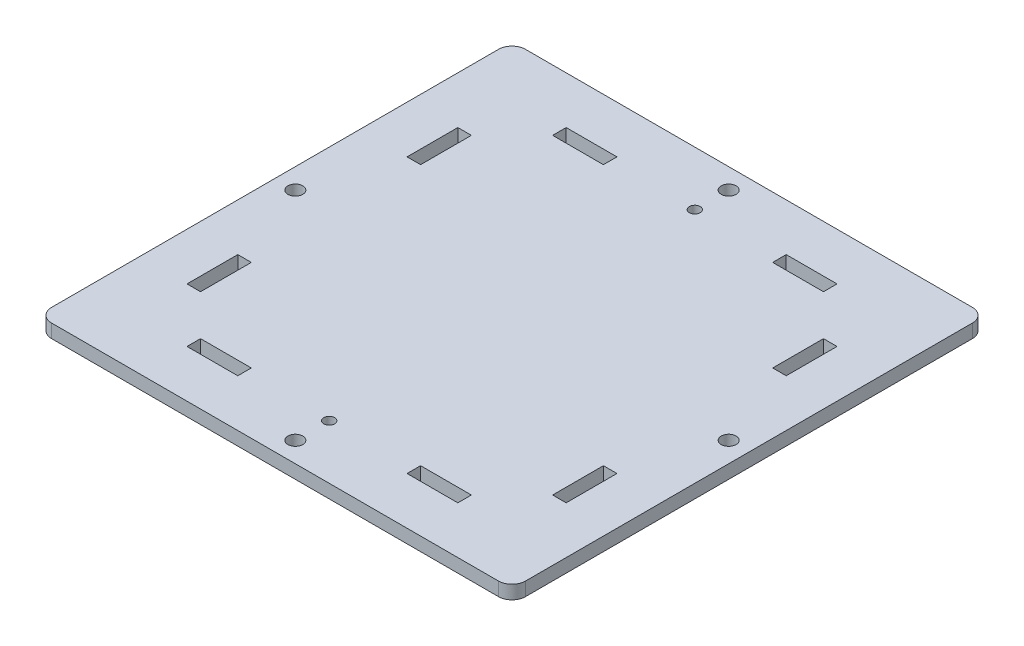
ISO-10303-21;
HEADER;
FILE_DESCRIPTION(('STEP AP214'),'2;1');
FILE_NAME('part.step','',(''),(''),'','','');
FILE_SCHEMA(('AUTOMOTIVE_DESIGN { 1 0 10303 214 1 1 1 1 }'));
ENDSEC;
DATA;
#1=APPLICATION_CONTEXT('core data for automotive mechanical design processes');
#2=APPLICATION_PROTOCOL_DEFINITION('international standard','automotive_design',2000,#1);
#3=PRODUCT_CONTEXT('',#1,'mechanical');
#4=PRODUCT('Part','Part','',(#3));
#5=PRODUCT_RELATED_PRODUCT_CATEGORY('part','',(#4));
#6=PRODUCT_DEFINITION_FORMATION('','',#4);
#7=PRODUCT_DEFINITION_CONTEXT('part definition',#1,'design');
#8=PRODUCT_DEFINITION('design','',#6,#7);
#9=PRODUCT_DEFINITION_SHAPE('','',#8);
#10=(LENGTH_UNIT() NAMED_UNIT(*) SI_UNIT(.MILLI.,.METRE.));
#11=(NAMED_UNIT(*) PLANE_ANGLE_UNIT() SI_UNIT($,.RADIAN.));
#12=(NAMED_UNIT(*) SI_UNIT($,.STERADIAN.) SOLID_ANGLE_UNIT());
#13=UNCERTAINTY_MEASURE_WITH_UNIT(LENGTH_MEASURE(1.E-05),#10,'distance_accuracy_value','');
#14=(GEOMETRIC_REPRESENTATION_CONTEXT(3) GLOBAL_UNCERTAINTY_ASSIGNED_CONTEXT((#13)) GLOBAL_UNIT_ASSIGNED_CONTEXT((#10,
#11,#12)) REPRESENTATION_CONTEXT('',''));
#15=CARTESIAN_POINT('',(0.,0.,0.));
#16=DIRECTION('',(0.,0.,1.));
#17=DIRECTION('',(1.,0.,0.));
#18=AXIS2_PLACEMENT_3D('',#15,#16,#17);
#19=CARTESIAN_POINT('',(-66.,-4.,-66.));
#20=DIRECTION('',(0.,-1.,0.));
#21=DIRECTION('',(0.,0.,-1.));
#22=AXIS2_PLACEMENT_3D('',#19,#20,#21);
#23=PLANE('',#22);
#24=CARTESIAN_POINT('',(0.,-4.,-64.));
#25=DIRECTION('',(0.,-1.,0.));
#26=DIRECTION('',(0.,0.,-1.));
#27=AXIS2_PLACEMENT_3D('',#24,#25,#26);
#28=CIRCLE('',#27,2.2);
#29=CARTESIAN_POINT('',(0.,-4.,-66.2));
#30=VERTEX_POINT('',#29);
#31=EDGE_CURVE('E844',#30,#30,#28,.T.);
#32=ORIENTED_EDGE('',*,*,#31,.F.);
#33=EDGE_LOOP('',(#32));
#34=FACE_BOUND('',#33,.T.);
#35=CARTESIAN_POINT('',(0.,-4.,64.));
#36=DIRECTION('',(0.,-1.,0.));
#37=DIRECTION('',(0.,0.,-1.));
#38=AXIS2_PLACEMENT_3D('',#35,#36,#37);
#39=CIRCLE('',#38,2.19999999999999);
#40=CARTESIAN_POINT('',(0.,-4.,61.8));
#41=VERTEX_POINT('',#40);
#42=EDGE_CURVE('E319',#41,#41,#39,.T.);
#43=ORIENTED_EDGE('',*,*,#42,.F.);
#44=EDGE_LOOP('',(#43));
#45=FACE_BOUND('',#44,.T.);
#46=DIRECTION('',(0.,0.,1.));
#47=VECTOR('',#46,1.);
#48=CARTESIAN_POINT('',(-52.,-4.,-40.));
#49=LINE('',#48,#47);
#50=CARTESIAN_POINT('',(-52.,-4.,-40.));
#51=VERTEX_POINT('',#50);
#52=CARTESIAN_POINT('',(-52.,-4.,-25.));
#53=VERTEX_POINT('',#52);
#54=EDGE_CURVE('E331',#51,#53,#49,.T.);
#55=ORIENTED_EDGE('',*,*,#54,.F.);
#56=DIRECTION('',(1.,0.,0.));
#57=VECTOR('',#56,1.);
#58=CARTESIAN_POINT('',(-56.,-4.,-40.));
#59=LINE('',#58,#57);
#60=CARTESIAN_POINT('',(-56.,-4.,-40.));
#61=VERTEX_POINT('',#60);
#62=EDGE_CURVE('E329',#61,#51,#59,.T.);
#63=ORIENTED_EDGE('',*,*,#62,.F.);
#64=DIRECTION('',(0.,0.,-1.));
#65=VECTOR('',#64,1.);
#66=CARTESIAN_POINT('',(-56.,-4.,-40.));
#67=LINE('',#66,#65);
#68=CARTESIAN_POINT('',(-56.,-4.,-25.));
#69=VERTEX_POINT('',#68);
#70=EDGE_CURVE('E337',#69,#61,#67,.T.);
#71=ORIENTED_EDGE('',*,*,#70,.F.);
#72=DIRECTION('',(-1.,0.,0.));
#73=VECTOR('',#72,1.);
#74=CARTESIAN_POINT('',(-56.,-4.,-25.));
#75=LINE('',#74,#73);
#76=EDGE_CURVE('E334',#53,#69,#75,.T.);
#77=ORIENTED_EDGE('',*,*,#76,.F.);
#78=EDGE_LOOP('',(#55,#63,#71,#77));
#79=FACE_BOUND('',#78,.T.);
#80=DIRECTION('',(-1.,0.,0.));
#81=VECTOR('',#80,1.);
#82=CARTESIAN_POINT('',(40.,-4.,-52.));
#83=LINE('',#82,#81);
#84=CARTESIAN_POINT('',(40.,-4.,-52.));
#85=VERTEX_POINT('',#84);
#86=CARTESIAN_POINT('',(25.,-4.,-52.));
#87=VERTEX_POINT('',#86);
#88=EDGE_CURVE('E393',#85,#87,#83,.T.);
#89=ORIENTED_EDGE('',*,*,#88,.F.);
#90=DIRECTION('',(0.,0.,1.));
#91=VECTOR('',#90,1.);
#92=CARTESIAN_POINT('',(40.,-4.,-56.));
#93=LINE('',#92,#91);
#94=CARTESIAN_POINT('',(40.,-4.,-56.));
#95=VERTEX_POINT('',#94);
#96=EDGE_CURVE('E391',#95,#85,#93,.T.);
#97=ORIENTED_EDGE('',*,*,#96,.F.);
#98=DIRECTION('',(1.,0.,0.));
#99=VECTOR('',#98,1.);
#100=CARTESIAN_POINT('',(40.,-4.,-56.));
#101=LINE('',#100,#99);
#102=CARTESIAN_POINT('',(25.,-4.,-56.));
#103=VERTEX_POINT('',#102);
#104=EDGE_CURVE('E399',#103,#95,#101,.T.);
#105=ORIENTED_EDGE('',*,*,#104,.F.);
#106=DIRECTION('',(0.,0.,-1.));
#107=VECTOR('',#106,1.);
#108=CARTESIAN_POINT('',(25.,-4.,-56.));
#109=LINE('',#108,#107);
#110=EDGE_CURVE('E396',#87,#103,#109,.T.);
#111=ORIENTED_EDGE('',*,*,#110,.F.);
#112=EDGE_LOOP('',(#89,#97,#105,#111));
#113=FACE_BOUND('',#112,.T.);
#114=DIRECTION('',(0.,0.,-1.));
#115=VECTOR('',#114,1.);
#116=CARTESIAN_POINT('',(52.,-4.,40.));
#117=LINE('',#116,#115);
#118=CARTESIAN_POINT('',(52.,-4.,40.));
#119=VERTEX_POINT('',#118);
#120=CARTESIAN_POINT('',(52.,-4.,25.));
#121=VERTEX_POINT('',#120);
#122=EDGE_CURVE('E455',#119,#121,#117,.T.);
#123=ORIENTED_EDGE('',*,*,#122,.F.);
#124=DIRECTION('',(-1.,0.,0.));
#125=VECTOR('',#124,1.);
#126=CARTESIAN_POINT('',(56.,-4.,40.));
#127=LINE('',#126,#125);
#128=CARTESIAN_POINT('',(56.,-4.,40.));
#129=VERTEX_POINT('',#128);
#130=EDGE_CURVE('E453',#129,#119,#127,.T.);
#131=ORIENTED_EDGE('',*,*,#130,.F.);
#132=DIRECTION('',(0.,0.,1.));
#133=VECTOR('',#132,1.);
#134=CARTESIAN_POINT('',(56.,-4.,40.));
#135=LINE('',#134,#133);
#136=CARTESIAN_POINT('',(56.,-4.,25.));
#137=VERTEX_POINT('',#136);
#138=EDGE_CURVE('E461',#137,#129,#135,.T.);
#139=ORIENTED_EDGE('',*,*,#138,.F.);
#140=DIRECTION('',(1.,0.,0.));
#141=VECTOR('',#140,1.);
#142=CARTESIAN_POINT('',(56.,-4.,25.));
#143=LINE('',#142,#141);
#144=EDGE_CURVE('E458',#121,#137,#143,.T.);
#145=ORIENTED_EDGE('',*,*,#144,.F.);
#146=EDGE_LOOP('',(#123,#131,#139,#145));
#147=FACE_BOUND('',#146,.T.);
#148=DIRECTION('',(1.,0.,0.));
#149=VECTOR('',#148,1.);
#150=CARTESIAN_POINT('',(-40.,-4.,52.));
#151=LINE('',#150,#149);
#152=CARTESIAN_POINT('',(-40.,-4.,52.));
#153=VERTEX_POINT('',#152);
#154=CARTESIAN_POINT('',(-25.,-4.,52.));
#155=VERTEX_POINT('',#154);
#156=EDGE_CURVE('E517',#153,#155,#151,.T.);
#157=ORIENTED_EDGE('',*,*,#156,.F.);
#158=DIRECTION('',(0.,0.,-1.));
#159=VECTOR('',#158,1.);
#160=CARTESIAN_POINT('',(-40.,-4.,56.));
#161=LINE('',#160,#159);
#162=CARTESIAN_POINT('',(-40.,-4.,56.));
#163=VERTEX_POINT('',#162);
#164=EDGE_CURVE('E515',#163,#153,#161,.T.);
#165=ORIENTED_EDGE('',*,*,#164,.F.);
#166=DIRECTION('',(-1.,0.,0.));
#167=VECTOR('',#166,1.);
#168=CARTESIAN_POINT('',(-40.,-4.,56.));
#169=LINE('',#168,#167);
#170=CARTESIAN_POINT('',(-25.,-4.,56.));
#171=VERTEX_POINT('',#170);
#172=EDGE_CURVE('E523',#171,#163,#169,.T.);
#173=ORIENTED_EDGE('',*,*,#172,.F.);
#174=DIRECTION('',(0.,0.,1.));
#175=VECTOR('',#174,1.);
#176=CARTESIAN_POINT('',(-25.,-4.,56.));
#177=LINE('',#176,#175);
#178=EDGE_CURVE('E520',#155,#171,#177,.T.);
#179=ORIENTED_EDGE('',*,*,#178,.F.);
#180=EDGE_LOOP('',(#157,#165,#173,#179));
#181=FACE_BOUND('',#180,.T.);
#182=CARTESIAN_POINT('',(0.,-4.,54.));
#183=DIRECTION('',(0.,-1.,0.));
#184=DIRECTION('',(0.,0.,-1.));
#185=AXIS2_PLACEMENT_3D('',#182,#183,#184);
#186=CIRCLE('',#185,1.6);
#187=CARTESIAN_POINT('',(0.,-4.,52.4));
#188=VERTEX_POINT('',#187);
#189=EDGE_CURVE('E552',#188,#188,#186,.T.);
#190=ORIENTED_EDGE('',*,*,#189,.F.);
#191=EDGE_LOOP('',(#190));
#192=FACE_BOUND('',#191,.T.);
#193=CARTESIAN_POINT('',(-66.,-4.,-66.));
#194=DIRECTION('',(0.,-1.,0.));
#195=DIRECTION('',(0.,0.,-1.));
#196=AXIS2_PLACEMENT_3D('',#193,#194,#195);
#197=CIRCLE('',#196,4.00000000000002);
#198=CARTESIAN_POINT('',(-70.,-4.,-66.));
#199=VERTEX_POINT('',#198);
#200=CARTESIAN_POINT('',(-66.,-4.,-70.));
#201=VERTEX_POINT('',#200);
#202=EDGE_CURVE('E558',#199,#201,#197,.T.);
#203=ORIENTED_EDGE('',*,*,#202,.T.);
#204=DIRECTION('',(1.,0.,0.));
#205=VECTOR('',#204,1.);
#206=CARTESIAN_POINT('',(-66.,-4.,-70.));
#207=LINE('',#206,#205);
#208=CARTESIAN_POINT('',(66.,-4.,-70.));
#209=VERTEX_POINT('',#208);
#210=EDGE_CURVE('E561',#201,#209,#207,.T.);
#211=ORIENTED_EDGE('',*,*,#210,.T.);
#212=CARTESIAN_POINT('',(66.,-4.,-66.));
#213=DIRECTION('',(0.,-1.,0.));
#214=DIRECTION('',(0.,0.,1.));
#215=AXIS2_PLACEMENT_3D('',#212,#213,#214);
#216=CIRCLE('',#215,4.00000000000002);
#217=CARTESIAN_POINT('',(70.,-4.,-66.));
#218=VERTEX_POINT('',#217);
#219=EDGE_CURVE('E564',#209,#218,#216,.T.);
#220=ORIENTED_EDGE('',*,*,#219,.T.);
#221=DIRECTION('',(0.,0.,1.));
#222=VECTOR('',#221,1.);
#223=CARTESIAN_POINT('',(70.,-4.,66.));
#224=LINE('',#223,#222);
#225=CARTESIAN_POINT('',(70.,-4.,66.));
#226=VERTEX_POINT('',#225);
#227=EDGE_CURVE('E566',#218,#226,#224,.T.);
#228=ORIENTED_EDGE('',*,*,#227,.T.);
#229=CARTESIAN_POINT('',(66.,-4.,66.));
#230=DIRECTION('',(0.,-1.,0.));
#231=DIRECTION('',(0.,0.,1.));
#232=AXIS2_PLACEMENT_3D('',#229,#230,#231);
#233=CIRCLE('',#232,4.00000000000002);
#234=CARTESIAN_POINT('',(66.,-4.,70.));
#235=VERTEX_POINT('',#234);
#236=EDGE_CURVE('E568',#226,#235,#233,.T.);
#237=ORIENTED_EDGE('',*,*,#236,.T.);
#238=DIRECTION('',(-1.,0.,0.));
#239=VECTOR('',#238,1.);
#240=CARTESIAN_POINT('',(-66.,-4.,70.));
#241=LINE('',#240,#239);
#242=CARTESIAN_POINT('',(-66.,-4.,70.));
#243=VERTEX_POINT('',#242);
#244=EDGE_CURVE('E570',#235,#243,#241,.T.);
#245=ORIENTED_EDGE('',*,*,#244,.T.);
#246=CARTESIAN_POINT('',(-66.,-4.,65.9999999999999));
#247=DIRECTION('',(0.,-1.,0.));
#248=DIRECTION('',(0.,0.,-1.));
#249=AXIS2_PLACEMENT_3D('',#246,#247,#248);
#250=CIRCLE('',#249,4.00000000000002);
#251=CARTESIAN_POINT('',(-70.,-4.,66.));
#252=VERTEX_POINT('',#251);
#253=EDGE_CURVE('E572',#243,#252,#250,.T.);
#254=ORIENTED_EDGE('',*,*,#253,.T.);
#255=DIRECTION('',(0.,0.,-1.));
#256=VECTOR('',#255,1.);
#257=CARTESIAN_POINT('',(-70.,-4.,66.));
#258=LINE('',#257,#256);
#259=EDGE_CURVE('E574',#252,#199,#258,.T.);
#260=ORIENTED_EDGE('',*,*,#259,.T.);
#261=EDGE_LOOP('',(#203,#211,#220,#228,#237,#245,#254,#260));
#262=FACE_BOUND('',#261,.T.);
#263=CARTESIAN_POINT('',(0.,-4.,-54.));
#264=DIRECTION('',(0.,-1.,0.));
#265=DIRECTION('',(0.,0.,1.));
#266=AXIS2_PLACEMENT_3D('',#263,#264,#265);
#267=CIRCLE('',#266,1.6);
#268=CARTESIAN_POINT('',(0.,-4.,-52.4));
#269=VERTEX_POINT('',#268);
#270=EDGE_CURVE('E546',#269,#269,#267,.T.);
#271=ORIENTED_EDGE('',*,*,#270,.F.);
#272=EDGE_LOOP('',(#271));
#273=FACE_BOUND('',#272,.T.);
#274=DIRECTION('',(0.,0.,-1.));
#275=VECTOR('',#274,1.);
#276=CARTESIAN_POINT('',(25.,-4.,56.));
#277=LINE('',#276,#275);
#278=CARTESIAN_POINT('',(25.,-4.,56.));
#279=VERTEX_POINT('',#278);
#280=CARTESIAN_POINT('',(25.,-4.,52.));
#281=VERTEX_POINT('',#280);
#282=EDGE_CURVE('E486',#279,#281,#277,.T.);
#283=ORIENTED_EDGE('',*,*,#282,.F.);
#284=DIRECTION('',(-1.,0.,0.));
#285=VECTOR('',#284,1.);
#286=CARTESIAN_POINT('',(40.,-4.,56.));
#287=LINE('',#286,#285);
#288=CARTESIAN_POINT('',(40.,-4.,56.));
#289=VERTEX_POINT('',#288);
#290=EDGE_CURVE('E484',#289,#279,#287,.T.);
#291=ORIENTED_EDGE('',*,*,#290,.F.);
#292=DIRECTION('',(0.,0.,1.));
#293=VECTOR('',#292,1.);
#294=CARTESIAN_POINT('',(40.,-4.,56.));
#295=LINE('',#294,#293);
#296=CARTESIAN_POINT('',(40.,-4.,52.));
#297=VERTEX_POINT('',#296);
#298=EDGE_CURVE('E492',#297,#289,#295,.T.);
#299=ORIENTED_EDGE('',*,*,#298,.F.);
#300=DIRECTION('',(1.,0.,0.));
#301=VECTOR('',#300,1.);
#302=CARTESIAN_POINT('',(40.,-4.,52.));
#303=LINE('',#302,#301);
#304=EDGE_CURVE('E489',#281,#297,#303,.T.);
#305=ORIENTED_EDGE('',*,*,#304,.F.);
#306=EDGE_LOOP('',(#283,#291,#299,#305));
#307=FACE_BOUND('',#306,.T.);
#308=DIRECTION('',(-1.,0.,0.));
#309=VECTOR('',#308,1.);
#310=CARTESIAN_POINT('',(56.,-4.,-25.));
#311=LINE('',#310,#309);
#312=CARTESIAN_POINT('',(56.,-4.,-25.));
#313=VERTEX_POINT('',#312);
#314=CARTESIAN_POINT('',(52.,-4.,-25.));
#315=VERTEX_POINT('',#314);
#316=EDGE_CURVE('E424',#313,#315,#311,.T.);
#317=ORIENTED_EDGE('',*,*,#316,.F.);
#318=DIRECTION('',(0.,0.,1.));
#319=VECTOR('',#318,1.);
#320=CARTESIAN_POINT('',(56.,-4.,-40.));
#321=LINE('',#320,#319);
#322=CARTESIAN_POINT('',(56.,-4.,-40.));
#323=VERTEX_POINT('',#322);
#324=EDGE_CURVE('E422',#323,#313,#321,.T.);
#325=ORIENTED_EDGE('',*,*,#324,.F.);
#326=DIRECTION('',(1.,0.,0.));
#327=VECTOR('',#326,1.);
#328=CARTESIAN_POINT('',(56.,-4.,-40.));
#329=LINE('',#328,#327);
#330=CARTESIAN_POINT('',(52.,-4.,-40.));
#331=VERTEX_POINT('',#330);
#332=EDGE_CURVE('E430',#331,#323,#329,.T.);
#333=ORIENTED_EDGE('',*,*,#332,.F.);
#334=DIRECTION('',(0.,0.,-1.));
#335=VECTOR('',#334,1.);
#336=CARTESIAN_POINT('',(52.,-4.,-40.));
#337=LINE('',#336,#335);
#338=EDGE_CURVE('E427',#315,#331,#337,.T.);
#339=ORIENTED_EDGE('',*,*,#338,.F.);
#340=EDGE_LOOP('',(#317,#325,#333,#339));
#341=FACE_BOUND('',#340,.T.);
#342=DIRECTION('',(0.,0.,1.));
#343=VECTOR('',#342,1.);
#344=CARTESIAN_POINT('',(-25.,-4.,-56.));
#345=LINE('',#344,#343);
#346=CARTESIAN_POINT('',(-25.,-4.,-56.));
#347=VERTEX_POINT('',#346);
#348=CARTESIAN_POINT('',(-25.,-4.,-52.));
#349=VERTEX_POINT('',#348);
#350=EDGE_CURVE('E362',#347,#349,#345,.T.);
#351=ORIENTED_EDGE('',*,*,#350,.F.);
#352=DIRECTION('',(1.,0.,0.));
#353=VECTOR('',#352,1.);
#354=CARTESIAN_POINT('',(-40.,-4.,-56.));
#355=LINE('',#354,#353);
#356=CARTESIAN_POINT('',(-40.,-4.,-56.));
#357=VERTEX_POINT('',#356);
#358=EDGE_CURVE('E360',#357,#347,#355,.T.);
#359=ORIENTED_EDGE('',*,*,#358,.F.);
#360=DIRECTION('',(0.,0.,-1.));
#361=VECTOR('',#360,1.);
#362=CARTESIAN_POINT('',(-40.,-4.,-56.));
#363=LINE('',#362,#361);
#364=CARTESIAN_POINT('',(-40.,-4.,-52.));
#365=VERTEX_POINT('',#364);
#366=EDGE_CURVE('E368',#365,#357,#363,.T.);
#367=ORIENTED_EDGE('',*,*,#366,.F.);
#368=DIRECTION('',(-1.,0.,0.));
#369=VECTOR('',#368,1.);
#370=CARTESIAN_POINT('',(-40.,-4.,-52.));
#371=LINE('',#370,#369);
#372=EDGE_CURVE('E365',#349,#365,#371,.T.);
#373=ORIENTED_EDGE('',*,*,#372,.F.);
#374=EDGE_LOOP('',(#351,#359,#367,#373));
#375=FACE_BOUND('',#374,.T.);
#376=DIRECTION('',(1.,0.,0.));
#377=VECTOR('',#376,1.);
#378=CARTESIAN_POINT('',(-56.,-4.,25.));
#379=LINE('',#378,#377);
#380=CARTESIAN_POINT('',(-56.,-4.,25.));
#381=VERTEX_POINT('',#380);
#382=CARTESIAN_POINT('',(-52.,-4.,25.));
#383=VERTEX_POINT('',#382);
#384=EDGE_CURVE('E298',#381,#383,#379,.T.);
#385=ORIENTED_EDGE('',*,*,#384,.F.);
#386=DIRECTION('',(0.,0.,-1.));
#387=VECTOR('',#386,1.);
#388=CARTESIAN_POINT('',(-56.,-4.,40.));
#389=LINE('',#388,#387);
#390=CARTESIAN_POINT('',(-56.,-4.,40.));
#391=VERTEX_POINT('',#390);
#392=EDGE_CURVE('E290',#391,#381,#389,.T.);
#393=ORIENTED_EDGE('',*,*,#392,.F.);
#394=DIRECTION('',(-1.,0.,0.));
#395=VECTOR('',#394,1.);
#396=CARTESIAN_POINT('',(-56.,-4.,40.));
#397=LINE('',#396,#395);
#398=CARTESIAN_POINT('',(-52.,-4.,40.));
#399=VERTEX_POINT('',#398);
#400=EDGE_CURVE('E313',#399,#391,#397,.T.);
#401=ORIENTED_EDGE('',*,*,#400,.F.);
#402=DIRECTION('',(0.,0.,1.));
#403=VECTOR('',#402,1.);
#404=CARTESIAN_POINT('',(-52.,-4.,40.));
#405=LINE('',#404,#403);
#406=EDGE_CURVE('E311',#383,#399,#405,.T.);
#407=ORIENTED_EDGE('',*,*,#406,.F.);
#408=EDGE_LOOP('',(#385,#393,#401,#407));
#409=FACE_BOUND('',#408,.T.);
#410=CARTESIAN_POINT('',(64.,-4.,0.));
#411=DIRECTION('',(0.,-1.,0.));
#412=DIRECTION('',(0.,0.,-1.));
#413=AXIS2_PLACEMENT_3D('',#410,#411,#412);
#414=CIRCLE('',#413,2.2);
#415=CARTESIAN_POINT('',(64.,-4.,-2.2));
#416=VERTEX_POINT('',#415);
#417=EDGE_CURVE('E850',#416,#416,#414,.T.);
#418=ORIENTED_EDGE('',*,*,#417,.F.);
#419=EDGE_LOOP('',(#418));
#420=FACE_BOUND('',#419,.T.);
#421=CARTESIAN_POINT('',(-64.,-4.,0.));
#422=DIRECTION('',(0.,-1.,0.));
#423=DIRECTION('',(0.,0.,-1.));
#424=AXIS2_PLACEMENT_3D('',#421,#422,#423);
#425=CIRCLE('',#424,2.2);
#426=CARTESIAN_POINT('',(-64.,-4.,-2.20000000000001));
#427=VERTEX_POINT('',#426);
#428=EDGE_CURVE('E835',#427,#427,#425,.T.);
#429=ORIENTED_EDGE('',*,*,#428,.F.);
#430=EDGE_LOOP('',(#429));
#431=FACE_BOUND('',#430,.T.);
#432=ADVANCED_FACE('F33',(#34,#45,#79,#113,#147,#181,#192,#262,#273,#307,#341,#375,#409,#420,
#431),#23,.T.);
#433=CARTESIAN_POINT('',(-66.,0.,-66.));
#434=DIRECTION('',(0.,-1.,0.));
#435=DIRECTION('',(0.,0.,-1.));
#436=AXIS2_PLACEMENT_3D('',#433,#434,#435);
#437=PLANE('',#436);
#438=CARTESIAN_POINT('',(0.,0.,-64.));
#439=DIRECTION('',(0.,-1.,0.));
#440=DIRECTION('',(0.,0.,-1.));
#441=AXIS2_PLACEMENT_3D('',#438,#439,#440);
#442=CIRCLE('',#441,2.2);
#443=CARTESIAN_POINT('',(0.,0.,-66.2));
#444=VERTEX_POINT('',#443);
#445=EDGE_CURVE('E841',#444,#444,#442,.T.);
#446=ORIENTED_EDGE('',*,*,#445,.T.);
#447=EDGE_LOOP('',(#446));
#448=FACE_BOUND('',#447,.T.);
#449=CARTESIAN_POINT('',(0.,0.,64.));
#450=DIRECTION('',(0.,-1.,0.));
#451=DIRECTION('',(0.,0.,-1.));
#452=AXIS2_PLACEMENT_3D('',#449,#450,#451);
#453=CIRCLE('',#452,2.19999999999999);
#454=CARTESIAN_POINT('',(0.,0.,61.8));
#455=VERTEX_POINT('',#454);
#456=EDGE_CURVE('E853',#455,#455,#453,.T.);
#457=ORIENTED_EDGE('',*,*,#456,.T.);
#458=EDGE_LOOP('',(#457));
#459=FACE_BOUND('',#458,.T.);
#460=DIRECTION('',(1.,0.,0.));
#461=VECTOR('',#460,1.);
#462=CARTESIAN_POINT('',(-56.,0.,-40.));
#463=LINE('',#462,#461);
#464=CARTESIAN_POINT('',(-56.,0.,-40.));
#465=VERTEX_POINT('',#464);
#466=CARTESIAN_POINT('',(-52.,0.,-40.));
#467=VERTEX_POINT('',#466);
#468=EDGE_CURVE('E306',#465,#467,#463,.T.);
#469=ORIENTED_EDGE('',*,*,#468,.T.);
#470=DIRECTION('',(0.,0.,1.));
#471=VECTOR('',#470,1.);
#472=CARTESIAN_POINT('',(-52.,0.,-40.));
#473=LINE('',#472,#471);
#474=CARTESIAN_POINT('',(-52.,0.,-25.));
#475=VERTEX_POINT('',#474);
#476=EDGE_CURVE('E342',#467,#475,#473,.T.);
#477=ORIENTED_EDGE('',*,*,#476,.T.);
#478=DIRECTION('',(-1.,0.,0.));
#479=VECTOR('',#478,1.);
#480=CARTESIAN_POINT('',(-56.,0.,-25.));
#481=LINE('',#480,#479);
#482=CARTESIAN_POINT('',(-56.,0.,-25.));
#483=VERTEX_POINT('',#482);
#484=EDGE_CURVE('E345',#475,#483,#481,.T.);
#485=ORIENTED_EDGE('',*,*,#484,.T.);
#486=DIRECTION('',(0.,0.,-1.));
#487=VECTOR('',#486,1.);
#488=CARTESIAN_POINT('',(-56.,0.,-40.));
#489=LINE('',#488,#487);
#490=EDGE_CURVE('E332',#483,#465,#489,.T.);
#491=ORIENTED_EDGE('',*,*,#490,.T.);
#492=EDGE_LOOP('',(#469,#477,#485,#491));
#493=FACE_BOUND('',#492,.T.);
#494=DIRECTION('',(0.,0.,1.));
#495=VECTOR('',#494,1.);
#496=CARTESIAN_POINT('',(40.,0.,-56.));
#497=LINE('',#496,#495);
#498=CARTESIAN_POINT('',(40.,0.,-56.));
#499=VERTEX_POINT('',#498);
#500=CARTESIAN_POINT('',(40.,0.,-52.));
#501=VERTEX_POINT('',#500);
#502=EDGE_CURVE('E390',#499,#501,#497,.T.);
#503=ORIENTED_EDGE('',*,*,#502,.T.);
#504=DIRECTION('',(-1.,0.,0.));
#505=VECTOR('',#504,1.);
#506=CARTESIAN_POINT('',(40.,0.,-52.));
#507=LINE('',#506,#505);
#508=CARTESIAN_POINT('',(25.,0.,-52.));
#509=VERTEX_POINT('',#508);
#510=EDGE_CURVE('E404',#501,#509,#507,.T.);
#511=ORIENTED_EDGE('',*,*,#510,.T.);
#512=DIRECTION('',(0.,0.,-1.));
#513=VECTOR('',#512,1.);
#514=CARTESIAN_POINT('',(25.,0.,-56.));
#515=LINE('',#514,#513);
#516=CARTESIAN_POINT('',(25.,0.,-56.));
#517=VERTEX_POINT('',#516);
#518=EDGE_CURVE('E407',#509,#517,#515,.T.);
#519=ORIENTED_EDGE('',*,*,#518,.T.);
#520=DIRECTION('',(1.,0.,0.));
#521=VECTOR('',#520,1.);
#522=CARTESIAN_POINT('',(40.,0.,-56.));
#523=LINE('',#522,#521);
#524=EDGE_CURVE('E394',#517,#499,#523,.T.);
#525=ORIENTED_EDGE('',*,*,#524,.T.);
#526=EDGE_LOOP('',(#503,#511,#519,#525));
#527=FACE_BOUND('',#526,.T.);
#528=DIRECTION('',(-1.,0.,0.));
#529=VECTOR('',#528,1.);
#530=CARTESIAN_POINT('',(56.,0.,40.));
#531=LINE('',#530,#529);
#532=CARTESIAN_POINT('',(56.,0.,40.));
#533=VERTEX_POINT('',#532);
#534=CARTESIAN_POINT('',(52.,0.,40.));
#535=VERTEX_POINT('',#534);
#536=EDGE_CURVE('E452',#533,#535,#531,.T.);
#537=ORIENTED_EDGE('',*,*,#536,.T.);
#538=DIRECTION('',(0.,0.,-1.));
#539=VECTOR('',#538,1.);
#540=CARTESIAN_POINT('',(52.,0.,40.));
#541=LINE('',#540,#539);
#542=CARTESIAN_POINT('',(52.,0.,25.));
#543=VERTEX_POINT('',#542);
#544=EDGE_CURVE('E466',#535,#543,#541,.T.);
#545=ORIENTED_EDGE('',*,*,#544,.T.);
#546=DIRECTION('',(1.,0.,0.));
#547=VECTOR('',#546,1.);
#548=CARTESIAN_POINT('',(56.,0.,25.));
#549=LINE('',#548,#547);
#550=CARTESIAN_POINT('',(56.,0.,25.));
#551=VERTEX_POINT('',#550);
#552=EDGE_CURVE('E469',#543,#551,#549,.T.);
#553=ORIENTED_EDGE('',*,*,#552,.T.);
#554=DIRECTION('',(0.,0.,1.));
#555=VECTOR('',#554,1.);
#556=CARTESIAN_POINT('',(56.,0.,40.));
#557=LINE('',#556,#555);
#558=EDGE_CURVE('E456',#551,#533,#557,.T.);
#559=ORIENTED_EDGE('',*,*,#558,.T.);
#560=EDGE_LOOP('',(#537,#545,#553,#559));
#561=FACE_BOUND('',#560,.T.);
#562=DIRECTION('',(0.,0.,-1.));
#563=VECTOR('',#562,1.);
#564=CARTESIAN_POINT('',(-40.,0.,56.));
#565=LINE('',#564,#563);
#566=CARTESIAN_POINT('',(-40.,0.,56.));
#567=VERTEX_POINT('',#566);
#568=CARTESIAN_POINT('',(-40.,0.,52.));
#569=VERTEX_POINT('',#568);
#570=EDGE_CURVE('E514',#567,#569,#565,.T.);
#571=ORIENTED_EDGE('',*,*,#570,.T.);
#572=DIRECTION('',(1.,0.,0.));
#573=VECTOR('',#572,1.);
#574=CARTESIAN_POINT('',(-40.,0.,52.));
#575=LINE('',#574,#573);
#576=CARTESIAN_POINT('',(-25.,0.,52.));
#577=VERTEX_POINT('',#576);
#578=EDGE_CURVE('E528',#569,#577,#575,.T.);
#579=ORIENTED_EDGE('',*,*,#578,.T.);
#580=DIRECTION('',(0.,0.,1.));
#581=VECTOR('',#580,1.);
#582=CARTESIAN_POINT('',(-25.,0.,56.));
#583=LINE('',#582,#581);
#584=CARTESIAN_POINT('',(-25.,0.,56.));
#585=VERTEX_POINT('',#584);
#586=EDGE_CURVE('E531',#577,#585,#583,.T.);
#587=ORIENTED_EDGE('',*,*,#586,.T.);
#588=DIRECTION('',(-1.,0.,0.));
#589=VECTOR('',#588,1.);
#590=CARTESIAN_POINT('',(-40.,0.,56.));
#591=LINE('',#590,#589);
#592=EDGE_CURVE('E518',#585,#567,#591,.T.);
#593=ORIENTED_EDGE('',*,*,#592,.T.);
#594=EDGE_LOOP('',(#571,#579,#587,#593));
#595=FACE_BOUND('',#594,.T.);
#596=CARTESIAN_POINT('',(0.,0.,54.));
#597=DIRECTION('',(0.,-1.,0.));
#598=DIRECTION('',(0.,0.,-1.));
#599=AXIS2_PLACEMENT_3D('',#596,#597,#598);
#600=CIRCLE('',#599,1.6);
#601=CARTESIAN_POINT('',(0.,0.,52.4));
#602=VERTEX_POINT('',#601);
#603=EDGE_CURVE('E549',#602,#602,#600,.T.);
#604=ORIENTED_EDGE('',*,*,#603,.T.);
#605=EDGE_LOOP('',(#604));
#606=FACE_BOUND('',#605,.T.);
#607=CARTESIAN_POINT('',(-66.,0.,-66.));
#608=DIRECTION('',(0.,-1.,0.));
#609=DIRECTION('',(0.,0.,-1.));
#610=AXIS2_PLACEMENT_3D('',#607,#608,#609);
#611=CIRCLE('',#610,4.00000000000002);
#612=CARTESIAN_POINT('',(-70.,0.,-66.));
#613=VERTEX_POINT('',#612);
#614=CARTESIAN_POINT('',(-66.,0.,-70.));
#615=VERTEX_POINT('',#614);
#616=EDGE_CURVE('E555',#613,#615,#611,.T.);
#617=ORIENTED_EDGE('',*,*,#616,.F.);
#618=DIRECTION('',(0.,0.,-1.));
#619=VECTOR('',#618,1.);
#620=CARTESIAN_POINT('',(-70.,0.,66.));
#621=LINE('',#620,#619);
#622=CARTESIAN_POINT('',(-70.,0.,66.));
#623=VERTEX_POINT('',#622);
#624=EDGE_CURVE('E562',#623,#613,#621,.T.);
#625=ORIENTED_EDGE('',*,*,#624,.F.);
#626=CARTESIAN_POINT('',(-66.,0.,65.9999999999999));
#627=DIRECTION('',(0.,-1.,0.));
#628=DIRECTION('',(0.,0.,-1.));
#629=AXIS2_PLACEMENT_3D('',#626,#627,#628);
#630=CIRCLE('',#629,4.00000000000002);
#631=CARTESIAN_POINT('',(-66.,0.,70.));
#632=VERTEX_POINT('',#631);
#633=EDGE_CURVE('E589',#632,#623,#630,.T.);
#634=ORIENTED_EDGE('',*,*,#633,.F.);
#635=DIRECTION('',(-1.,0.,0.));
#636=VECTOR('',#635,1.);
#637=CARTESIAN_POINT('',(-66.,0.,70.));
#638=LINE('',#637,#636);
#639=CARTESIAN_POINT('',(66.,0.,70.));
#640=VERTEX_POINT('',#639);
#641=EDGE_CURVE('E587',#640,#632,#638,.T.);
#642=ORIENTED_EDGE('',*,*,#641,.F.);
#643=CARTESIAN_POINT('',(66.,0.,66.));
#644=DIRECTION('',(0.,-1.,0.));
#645=DIRECTION('',(0.,0.,1.));
#646=AXIS2_PLACEMENT_3D('',#643,#644,#645);
#647=CIRCLE('',#646,4.00000000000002);
#648=CARTESIAN_POINT('',(70.,0.,66.));
#649=VERTEX_POINT('',#648);
#650=EDGE_CURVE('E585',#649,#640,#647,.T.);
#651=ORIENTED_EDGE('',*,*,#650,.F.);
#652=DIRECTION('',(0.,0.,1.));
#653=VECTOR('',#652,1.);
#654=CARTESIAN_POINT('',(70.,0.,66.));
#655=LINE('',#654,#653);
#656=CARTESIAN_POINT('',(70.,0.,-66.));
#657=VERTEX_POINT('',#656);
#658=EDGE_CURVE('E583',#657,#649,#655,.T.);
#659=ORIENTED_EDGE('',*,*,#658,.F.);
#660=CARTESIAN_POINT('',(66.,0.,-66.));
#661=DIRECTION('',(0.,-1.,0.));
#662=DIRECTION('',(0.,0.,1.));
#663=AXIS2_PLACEMENT_3D('',#660,#661,#662);
#664=CIRCLE('',#663,4.00000000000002);
#665=CARTESIAN_POINT('',(66.,0.,-70.));
#666=VERTEX_POINT('',#665);
#667=EDGE_CURVE('E581',#666,#657,#664,.T.);
#668=ORIENTED_EDGE('',*,*,#667,.F.);
#669=DIRECTION('',(1.,0.,0.));
#670=VECTOR('',#669,1.);
#671=CARTESIAN_POINT('',(-66.,0.,-70.));
#672=LINE('',#671,#670);
#673=EDGE_CURVE('E579',#615,#666,#672,.T.);
#674=ORIENTED_EDGE('',*,*,#673,.F.);
#675=EDGE_LOOP('',(#617,#625,#634,#642,#651,#659,#668,#674));
#676=FACE_BOUND('',#675,.T.);
#677=CARTESIAN_POINT('',(0.,0.,-54.));
#678=DIRECTION('',(0.,-1.,0.));
#679=DIRECTION('',(0.,0.,1.));
#680=AXIS2_PLACEMENT_3D('',#677,#678,#679);
#681=CIRCLE('',#680,1.6);
#682=CARTESIAN_POINT('',(0.,0.,-52.4));
#683=VERTEX_POINT('',#682);
#684=EDGE_CURVE('E545',#683,#683,#681,.T.);
#685=ORIENTED_EDGE('',*,*,#684,.T.);
#686=EDGE_LOOP('',(#685));
#687=FACE_BOUND('',#686,.T.);
#688=DIRECTION('',(-1.,0.,0.));
#689=VECTOR('',#688,1.);
#690=CARTESIAN_POINT('',(40.,0.,56.));
#691=LINE('',#690,#689);
#692=CARTESIAN_POINT('',(40.,0.,56.));
#693=VERTEX_POINT('',#692);
#694=CARTESIAN_POINT('',(25.,0.,56.));
#695=VERTEX_POINT('',#694);
#696=EDGE_CURVE('E483',#693,#695,#691,.T.);
#697=ORIENTED_EDGE('',*,*,#696,.T.);
#698=DIRECTION('',(0.,0.,-1.));
#699=VECTOR('',#698,1.);
#700=CARTESIAN_POINT('',(25.,0.,56.));
#701=LINE('',#700,#699);
#702=CARTESIAN_POINT('',(25.,0.,52.));
#703=VERTEX_POINT('',#702);
#704=EDGE_CURVE('E497',#695,#703,#701,.T.);
#705=ORIENTED_EDGE('',*,*,#704,.T.);
#706=DIRECTION('',(1.,0.,0.));
#707=VECTOR('',#706,1.);
#708=CARTESIAN_POINT('',(40.,0.,52.));
#709=LINE('',#708,#707);
#710=CARTESIAN_POINT('',(40.,0.,52.));
#711=VERTEX_POINT('',#710);
#712=EDGE_CURVE('E500',#703,#711,#709,.T.);
#713=ORIENTED_EDGE('',*,*,#712,.T.);
#714=DIRECTION('',(0.,0.,1.));
#715=VECTOR('',#714,1.);
#716=CARTESIAN_POINT('',(40.,0.,56.));
#717=LINE('',#716,#715);
#718=EDGE_CURVE('E487',#711,#693,#717,.T.);
#719=ORIENTED_EDGE('',*,*,#718,.T.);
#720=EDGE_LOOP('',(#697,#705,#713,#719));
#721=FACE_BOUND('',#720,.T.);
#722=DIRECTION('',(0.,0.,1.));
#723=VECTOR('',#722,1.);
#724=CARTESIAN_POINT('',(56.,0.,-40.));
#725=LINE('',#724,#723);
#726=CARTESIAN_POINT('',(56.,0.,-40.));
#727=VERTEX_POINT('',#726);
#728=CARTESIAN_POINT('',(56.,0.,-25.));
#729=VERTEX_POINT('',#728);
#730=EDGE_CURVE('E421',#727,#729,#725,.T.);
#731=ORIENTED_EDGE('',*,*,#730,.T.);
#732=DIRECTION('',(-1.,0.,0.));
#733=VECTOR('',#732,1.);
#734=CARTESIAN_POINT('',(56.,0.,-25.));
#735=LINE('',#734,#733);
#736=CARTESIAN_POINT('',(52.,0.,-25.));
#737=VERTEX_POINT('',#736);
#738=EDGE_CURVE('E435',#729,#737,#735,.T.);
#739=ORIENTED_EDGE('',*,*,#738,.T.);
#740=DIRECTION('',(0.,0.,-1.));
#741=VECTOR('',#740,1.);
#742=CARTESIAN_POINT('',(52.,0.,-40.));
#743=LINE('',#742,#741);
#744=CARTESIAN_POINT('',(52.,0.,-40.));
#745=VERTEX_POINT('',#744);
#746=EDGE_CURVE('E438',#737,#745,#743,.T.);
#747=ORIENTED_EDGE('',*,*,#746,.T.);
#748=DIRECTION('',(1.,0.,0.));
#749=VECTOR('',#748,1.);
#750=CARTESIAN_POINT('',(56.,0.,-40.));
#751=LINE('',#750,#749);
#752=EDGE_CURVE('E425',#745,#727,#751,.T.);
#753=ORIENTED_EDGE('',*,*,#752,.T.);
#754=EDGE_LOOP('',(#731,#739,#747,#753));
#755=FACE_BOUND('',#754,.T.);
#756=DIRECTION('',(1.,0.,0.));
#757=VECTOR('',#756,1.);
#758=CARTESIAN_POINT('',(-40.,0.,-56.));
#759=LINE('',#758,#757);
#760=CARTESIAN_POINT('',(-40.,0.,-56.));
#761=VERTEX_POINT('',#760);
#762=CARTESIAN_POINT('',(-25.,0.,-56.));
#763=VERTEX_POINT('',#762);
#764=EDGE_CURVE('E359',#761,#763,#759,.T.);
#765=ORIENTED_EDGE('',*,*,#764,.T.);
#766=DIRECTION('',(0.,0.,1.));
#767=VECTOR('',#766,1.);
#768=CARTESIAN_POINT('',(-25.,0.,-56.));
#769=LINE('',#768,#767);
#770=CARTESIAN_POINT('',(-25.,0.,-52.));
#771=VERTEX_POINT('',#770);
#772=EDGE_CURVE('E373',#763,#771,#769,.T.);
#773=ORIENTED_EDGE('',*,*,#772,.T.);
#774=DIRECTION('',(-1.,0.,0.));
#775=VECTOR('',#774,1.);
#776=CARTESIAN_POINT('',(-40.,0.,-52.));
#777=LINE('',#776,#775);
#778=CARTESIAN_POINT('',(-40.,0.,-52.));
#779=VERTEX_POINT('',#778);
#780=EDGE_CURVE('E376',#771,#779,#777,.T.);
#781=ORIENTED_EDGE('',*,*,#780,.T.);
#782=DIRECTION('',(0.,0.,-1.));
#783=VECTOR('',#782,1.);
#784=CARTESIAN_POINT('',(-40.,0.,-56.));
#785=LINE('',#784,#783);
#786=EDGE_CURVE('E363',#779,#761,#785,.T.);
#787=ORIENTED_EDGE('',*,*,#786,.T.);
#788=EDGE_LOOP('',(#765,#773,#781,#787));
#789=FACE_BOUND('',#788,.T.);
#790=DIRECTION('',(0.,0.,-1.));
#791=VECTOR('',#790,1.);
#792=CARTESIAN_POINT('',(-56.,0.,40.));
#793=LINE('',#792,#791);
#794=CARTESIAN_POINT('',(-56.,0.,40.));
#795=VERTEX_POINT('',#794);
#796=CARTESIAN_POINT('',(-56.,0.,25.));
#797=VERTEX_POINT('',#796);
#798=EDGE_CURVE('E56',#795,#797,#793,.T.);
#799=ORIENTED_EDGE('',*,*,#798,.T.);
#800=DIRECTION('',(1.,0.,0.));
#801=VECTOR('',#800,1.);
#802=CARTESIAN_POINT('',(-56.,0.,25.));
#803=LINE('',#802,#801);
#804=CARTESIAN_POINT('',(-52.,0.,25.));
#805=VERTEX_POINT('',#804);
#806=EDGE_CURVE('E305',#797,#805,#803,.T.);
#807=ORIENTED_EDGE('',*,*,#806,.T.);
#808=DIRECTION('',(0.,0.,1.));
#809=VECTOR('',#808,1.);
#810=CARTESIAN_POINT('',(-52.,0.,40.));
#811=LINE('',#810,#809);
#812=CARTESIAN_POINT('',(-52.,0.,40.));
#813=VERTEX_POINT('',#812);
#814=EDGE_CURVE('E321',#805,#813,#811,.T.);
#815=ORIENTED_EDGE('',*,*,#814,.T.);
#816=DIRECTION('',(-1.,0.,0.));
#817=VECTOR('',#816,1.);
#818=CARTESIAN_POINT('',(-56.,0.,40.));
#819=LINE('',#818,#817);
#820=EDGE_CURVE('E299',#813,#795,#819,.T.);
#821=ORIENTED_EDGE('',*,*,#820,.T.);
#822=EDGE_LOOP('',(#799,#807,#815,#821));
#823=FACE_BOUND('',#822,.T.);
#824=CARTESIAN_POINT('',(64.,0.,0.));
#825=DIRECTION('',(0.,-1.,0.));
#826=DIRECTION('',(0.,0.,-1.));
#827=AXIS2_PLACEMENT_3D('',#824,#825,#826);
#828=CIRCLE('',#827,2.2);
#829=CARTESIAN_POINT('',(64.,0.,-2.2));
#830=VERTEX_POINT('',#829);
#831=EDGE_CURVE('E847',#830,#830,#828,.T.);
#832=ORIENTED_EDGE('',*,*,#831,.T.);
#833=EDGE_LOOP('',(#832));
#834=FACE_BOUND('',#833,.T.);
#835=CARTESIAN_POINT('',(-64.,0.,0.));
#836=DIRECTION('',(0.,-1.,0.));
#837=DIRECTION('',(0.,0.,-1.));
#838=AXIS2_PLACEMENT_3D('',#835,#836,#837);
#839=CIRCLE('',#838,2.2);
#840=CARTESIAN_POINT('',(-64.,0.,-2.20000000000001));
#841=VERTEX_POINT('',#840);
#842=EDGE_CURVE('E838',#841,#841,#839,.T.);
#843=ORIENTED_EDGE('',*,*,#842,.T.);
#844=EDGE_LOOP('',(#843));
#845=FACE_BOUND('',#844,.T.);
#846=ADVANCED_FACE('F619',(#448,#459,#493,#527,#561,#595,#606,#676,#687,#721,#755,#789,#823,
#834,#845),#437,.F.);
#847=CARTESIAN_POINT('',(-66.,-4.,-66.));
#848=DIRECTION('',(0.,1.,0.));
#849=DIRECTION('',(0.,0.,1.));
#850=AXIS2_PLACEMENT_3D('',#847,#848,#849);
#851=CYLINDRICAL_SURFACE('',#850,4.00000000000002);
#852=ORIENTED_EDGE('',*,*,#616,.T.);
#853=DIRECTION('',(0.,1.,0.));
#854=VECTOR('',#853,1.);
#855=CARTESIAN_POINT('',(-66.,-4.,-70.));
#856=LINE('',#855,#854);
#857=EDGE_CURVE('E11',#201,#615,#856,.T.);
#858=ORIENTED_EDGE('',*,*,#857,.F.);
#859=ORIENTED_EDGE('',*,*,#202,.F.);
#860=DIRECTION('',(0.,1.,0.));
#861=VECTOR('',#860,1.);
#862=CARTESIAN_POINT('',(-70.,-4.,-66.));
#863=LINE('',#862,#861);
#864=EDGE_CURVE('E576',#199,#613,#863,.T.);
#865=ORIENTED_EDGE('',*,*,#864,.T.);
#866=EDGE_LOOP('',(#852,#858,#859,#865));
#867=FACE_BOUND('',#866,.T.);
#868=ADVANCED_FACE('F35',(#867),#851,.T.);
#869=CARTESIAN_POINT('',(-66.,-4.,-70.));
#870=DIRECTION('',(0.,0.,1.));
#871=DIRECTION('',(1.,0.,0.));
#872=AXIS2_PLACEMENT_3D('',#869,#870,#871);
#873=PLANE('',#872);
#874=ORIENTED_EDGE('',*,*,#673,.T.);
#875=DIRECTION('',(0.,1.,0.));
#876=VECTOR('',#875,1.);
#877=CARTESIAN_POINT('',(66.,-4.,-70.));
#878=LINE('',#877,#876);
#879=EDGE_CURVE('E41',#209,#666,#878,.T.);
#880=ORIENTED_EDGE('',*,*,#879,.F.);
#881=ORIENTED_EDGE('',*,*,#210,.F.);
#882=ORIENTED_EDGE('',*,*,#857,.T.);
#883=EDGE_LOOP('',(#874,#880,#881,#882));
#884=FACE_BOUND('',#883,.T.);
#885=ADVANCED_FACE('F637',(#884),#873,.F.);
#886=CARTESIAN_POINT('',(66.,-4.,-66.));
#887=DIRECTION('',(0.,1.,0.));
#888=DIRECTION('',(0.,0.,1.));
#889=AXIS2_PLACEMENT_3D('',#886,#887,#888);
#890=CYLINDRICAL_SURFACE('',#889,4.00000000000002);
#891=ORIENTED_EDGE('',*,*,#667,.T.);
#892=DIRECTION('',(0.,1.,0.));
#893=VECTOR('',#892,1.);
#894=CARTESIAN_POINT('',(70.,-4.,-66.));
#895=LINE('',#894,#893);
#896=EDGE_CURVE('E606',#218,#657,#895,.T.);
#897=ORIENTED_EDGE('',*,*,#896,.F.);
#898=ORIENTED_EDGE('',*,*,#219,.F.);
#899=ORIENTED_EDGE('',*,*,#879,.T.);
#900=EDGE_LOOP('',(#891,#897,#898,#899));
#901=FACE_BOUND('',#900,.T.);
#902=ADVANCED_FACE('F613',(#901),#890,.T.);
#903=CARTESIAN_POINT('',(70.,-4.,66.));
#904=DIRECTION('',(-1.,0.,0.));
#905=DIRECTION('',(0.,0.,1.));
#906=AXIS2_PLACEMENT_3D('',#903,#904,#905);
#907=PLANE('',#906);
#908=ORIENTED_EDGE('',*,*,#658,.T.);
#909=DIRECTION('',(0.,1.,0.));
#910=VECTOR('',#909,1.);
#911=CARTESIAN_POINT('',(70.,-4.,66.));
#912=LINE('',#911,#910);
#913=EDGE_CURVE('E603',#226,#649,#912,.T.);
#914=ORIENTED_EDGE('',*,*,#913,.F.);
#915=ORIENTED_EDGE('',*,*,#227,.F.);
#916=ORIENTED_EDGE('',*,*,#896,.T.);
#917=EDGE_LOOP('',(#908,#914,#915,#916));
#918=FACE_BOUND('',#917,.T.);
#919=ADVANCED_FACE('F625',(#918),#907,.F.);
#920=CARTESIAN_POINT('',(66.,-4.,66.));
#921=DIRECTION('',(0.,1.,0.));
#922=DIRECTION('',(0.,0.,1.));
#923=AXIS2_PLACEMENT_3D('',#920,#921,#922);
#924=CYLINDRICAL_SURFACE('',#923,4.00000000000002);
#925=ORIENTED_EDGE('',*,*,#650,.T.);
#926=DIRECTION('',(0.,1.,0.));
#927=VECTOR('',#926,1.);
#928=CARTESIAN_POINT('',(66.,-4.,70.));
#929=LINE('',#928,#927);
#930=EDGE_CURVE('E600',#235,#640,#929,.T.);
#931=ORIENTED_EDGE('',*,*,#930,.F.);
#932=ORIENTED_EDGE('',*,*,#236,.F.);
#933=ORIENTED_EDGE('',*,*,#913,.T.);
#934=EDGE_LOOP('',(#925,#931,#932,#933));
#935=FACE_BOUND('',#934,.T.);
#936=ADVANCED_FACE('F629',(#935),#924,.T.);
#937=CARTESIAN_POINT('',(-66.,-4.,70.));
#938=DIRECTION('',(0.,0.,-1.));
#939=DIRECTION('',(-1.,0.,0.));
#940=AXIS2_PLACEMENT_3D('',#937,#938,#939);
#941=PLANE('',#940);
#942=ORIENTED_EDGE('',*,*,#641,.T.);
#943=DIRECTION('',(0.,1.,0.));
#944=VECTOR('',#943,1.);
#945=CARTESIAN_POINT('',(-66.,-4.,70.));
#946=LINE('',#945,#944);
#947=EDGE_CURVE('E597',#243,#632,#946,.T.);
#948=ORIENTED_EDGE('',*,*,#947,.F.);
#949=ORIENTED_EDGE('',*,*,#244,.F.);
#950=ORIENTED_EDGE('',*,*,#930,.T.);
#951=EDGE_LOOP('',(#942,#948,#949,#950));
#952=FACE_BOUND('',#951,.T.);
#953=ADVANCED_FACE('F650',(#952),#941,.F.);
#954=CARTESIAN_POINT('',(-66.,-4.,65.9999999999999));
#955=DIRECTION('',(0.,1.,0.));
#956=DIRECTION('',(0.,0.,1.));
#957=AXIS2_PLACEMENT_3D('',#954,#955,#956);
#958=CYLINDRICAL_SURFACE('',#957,4.00000000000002);
#959=ORIENTED_EDGE('',*,*,#633,.T.);
#960=DIRECTION('',(0.,1.,0.));
#961=VECTOR('',#960,1.);
#962=CARTESIAN_POINT('',(-70.,-4.,66.));
#963=LINE('',#962,#961);
#964=EDGE_CURVE('E594',#252,#623,#963,.T.);
#965=ORIENTED_EDGE('',*,*,#964,.F.);
#966=ORIENTED_EDGE('',*,*,#253,.F.);
#967=ORIENTED_EDGE('',*,*,#947,.T.);
#968=EDGE_LOOP('',(#959,#965,#966,#967));
#969=FACE_BOUND('',#968,.T.);
#970=ADVANCED_FACE('F648',(#969),#958,.T.);
#971=CARTESIAN_POINT('',(-70.,-4.,66.));
#972=DIRECTION('',(1.,0.,0.));
#973=DIRECTION('',(0.,0.,-1.));
#974=AXIS2_PLACEMENT_3D('',#971,#972,#973);
#975=PLANE('',#974);
#976=ORIENTED_EDGE('',*,*,#624,.T.);
#977=ORIENTED_EDGE('',*,*,#864,.F.);
#978=ORIENTED_EDGE('',*,*,#259,.F.);
#979=ORIENTED_EDGE('',*,*,#964,.T.);
#980=EDGE_LOOP('',(#976,#977,#978,#979));
#981=FACE_BOUND('',#980,.T.);
#982=ADVANCED_FACE('F643',(#981),#975,.F.);
#983=CARTESIAN_POINT('',(0.,-4.,54.));
#984=DIRECTION('',(0.,1.,0.));
#985=DIRECTION('',(0.,0.,1.));
#986=AXIS2_PLACEMENT_3D('',#983,#984,#985);
#987=CYLINDRICAL_SURFACE('',#986,1.6);
#988=ORIENTED_EDGE('',*,*,#189,.T.);
#989=EDGE_LOOP('',(#988));
#990=FACE_BOUND('',#989,.T.);
#991=ORIENTED_EDGE('',*,*,#603,.F.);
#992=EDGE_LOOP('',(#991));
#993=FACE_BOUND('',#992,.T.);
#994=ADVANCED_FACE('F670',(#990,#993),#987,.F.);
#995=CARTESIAN_POINT('',(0.,-4.,-54.));
#996=DIRECTION('',(0.,1.,0.));
#997=DIRECTION('',(0.,0.,1.));
#998=AXIS2_PLACEMENT_3D('',#995,#996,#997);
#999=CYLINDRICAL_SURFACE('',#998,1.6);
#1000=ORIENTED_EDGE('',*,*,#270,.T.);
#1001=EDGE_LOOP('',(#1000));
#1002=FACE_BOUND('',#1001,.T.);
#1003=ORIENTED_EDGE('',*,*,#684,.F.);
#1004=EDGE_LOOP('',(#1003));
#1005=FACE_BOUND('',#1004,.T.);
#1006=ADVANCED_FACE('F677',(#1002,#1005),#999,.F.);
#1007=CARTESIAN_POINT('',(-40.,-4.,56.));
#1008=DIRECTION('',(1.,0.,0.));
#1009=DIRECTION('',(0.,0.,-1.));
#1010=AXIS2_PLACEMENT_3D('',#1007,#1008,#1009);
#1011=PLANE('',#1010);
#1012=ORIENTED_EDGE('',*,*,#570,.F.);
#1013=DIRECTION('',(0.,1.,0.));
#1014=VECTOR('',#1013,1.);
#1015=CARTESIAN_POINT('',(-40.,-4.,56.));
#1016=LINE('',#1015,#1014);
#1017=EDGE_CURVE('E525',#163,#567,#1016,.T.);
#1018=ORIENTED_EDGE('',*,*,#1017,.F.);
#1019=ORIENTED_EDGE('',*,*,#164,.T.);
#1020=DIRECTION('',(0.,1.,0.));
#1021=VECTOR('',#1020,1.);
#1022=CARTESIAN_POINT('',(-40.,-4.,52.));
#1023=LINE('',#1022,#1021);
#1024=EDGE_CURVE('E542',#153,#569,#1023,.T.);
#1025=ORIENTED_EDGE('',*,*,#1024,.T.);
#1026=EDGE_LOOP('',(#1012,#1018,#1019,#1025));
#1027=FACE_BOUND('',#1026,.T.);
#1028=ADVANCED_FACE('F682',(#1027),#1011,.T.);
#1029=CARTESIAN_POINT('',(-40.,-4.,52.));
#1030=DIRECTION('',(0.,0.,1.));
#1031=DIRECTION('',(1.,0.,0.));
#1032=AXIS2_PLACEMENT_3D('',#1029,#1030,#1031);
#1033=PLANE('',#1032);
#1034=ORIENTED_EDGE('',*,*,#578,.F.);
#1035=ORIENTED_EDGE('',*,*,#1024,.F.);
#1036=ORIENTED_EDGE('',*,*,#156,.T.);
#1037=DIRECTION('',(0.,1.,0.));
#1038=VECTOR('',#1037,1.);
#1039=CARTESIAN_POINT('',(-25.,-4.,52.));
#1040=LINE('',#1039,#1038);
#1041=EDGE_CURVE('E540',#155,#577,#1040,.T.);
#1042=ORIENTED_EDGE('',*,*,#1041,.T.);
#1043=EDGE_LOOP('',(#1034,#1035,#1036,#1042));
#1044=FACE_BOUND('',#1043,.T.);
#1045=ADVANCED_FACE('F692',(#1044),#1033,.T.);
#1046=CARTESIAN_POINT('',(-25.,-4.,56.));
#1047=DIRECTION('',(-1.,0.,0.));
#1048=DIRECTION('',(0.,0.,1.));
#1049=AXIS2_PLACEMENT_3D('',#1046,#1047,#1048);
#1050=PLANE('',#1049);
#1051=ORIENTED_EDGE('',*,*,#586,.F.);
#1052=ORIENTED_EDGE('',*,*,#1041,.F.);
#1053=ORIENTED_EDGE('',*,*,#178,.T.);
#1054=DIRECTION('',(0.,1.,0.));
#1055=VECTOR('',#1054,1.);
#1056=CARTESIAN_POINT('',(-25.,-4.,56.));
#1057=LINE('',#1056,#1055);
#1058=EDGE_CURVE('E538',#171,#585,#1057,.T.);
#1059=ORIENTED_EDGE('',*,*,#1058,.T.);
#1060=EDGE_LOOP('',(#1051,#1052,#1053,#1059));
#1061=FACE_BOUND('',#1060,.T.);
#1062=ADVANCED_FACE('F699',(#1061),#1050,.T.);
#1063=CARTESIAN_POINT('',(-40.,-4.,56.));
#1064=DIRECTION('',(0.,0.,-1.));
#1065=DIRECTION('',(-1.,0.,0.));
#1066=AXIS2_PLACEMENT_3D('',#1063,#1064,#1065);
#1067=PLANE('',#1066);
#1068=ORIENTED_EDGE('',*,*,#592,.F.);
#1069=ORIENTED_EDGE('',*,*,#1058,.F.);
#1070=ORIENTED_EDGE('',*,*,#172,.T.);
#1071=ORIENTED_EDGE('',*,*,#1017,.T.);
#1072=EDGE_LOOP('',(#1068,#1069,#1070,#1071));
#1073=FACE_BOUND('',#1072,.T.);
#1074=ADVANCED_FACE('F703',(#1073),#1067,.T.);
#1075=CARTESIAN_POINT('',(40.,-4.,56.));
#1076=DIRECTION('',(0.,0.,-1.));
#1077=DIRECTION('',(-1.,0.,0.));
#1078=AXIS2_PLACEMENT_3D('',#1075,#1076,#1077);
#1079=PLANE('',#1078);
#1080=ORIENTED_EDGE('',*,*,#696,.F.);
#1081=DIRECTION('',(0.,1.,0.));
#1082=VECTOR('',#1081,1.);
#1083=CARTESIAN_POINT('',(40.,-4.,56.));
#1084=LINE('',#1083,#1082);
#1085=EDGE_CURVE('E494',#289,#693,#1084,.T.);
#1086=ORIENTED_EDGE('',*,*,#1085,.F.);
#1087=ORIENTED_EDGE('',*,*,#290,.T.);
#1088=DIRECTION('',(0.,1.,0.));
#1089=VECTOR('',#1088,1.);
#1090=CARTESIAN_POINT('',(25.,-4.,56.));
#1091=LINE('',#1090,#1089);
#1092=EDGE_CURVE('E511',#279,#695,#1091,.T.);
#1093=ORIENTED_EDGE('',*,*,#1092,.T.);
#1094=EDGE_LOOP('',(#1080,#1086,#1087,#1093));
#1095=FACE_BOUND('',#1094,.T.);
#1096=ADVANCED_FACE('F707',(#1095),#1079,.T.);
#1097=CARTESIAN_POINT('',(25.,-4.,56.));
#1098=DIRECTION('',(1.,0.,0.));
#1099=DIRECTION('',(0.,0.,-1.));
#1100=AXIS2_PLACEMENT_3D('',#1097,#1098,#1099);
#1101=PLANE('',#1100);
#1102=ORIENTED_EDGE('',*,*,#704,.F.);
#1103=ORIENTED_EDGE('',*,*,#1092,.F.);
#1104=ORIENTED_EDGE('',*,*,#282,.T.);
#1105=DIRECTION('',(0.,1.,0.));
#1106=VECTOR('',#1105,1.);
#1107=CARTESIAN_POINT('',(25.,-4.,52.));
#1108=LINE('',#1107,#1106);
#1109=EDGE_CURVE('E509',#281,#703,#1108,.T.);
#1110=ORIENTED_EDGE('',*,*,#1109,.T.);
#1111=EDGE_LOOP('',(#1102,#1103,#1104,#1110));
#1112=FACE_BOUND('',#1111,.T.);
#1113=ADVANCED_FACE('F711',(#1112),#1101,.T.);
#1114=CARTESIAN_POINT('',(40.,-4.,52.));
#1115=DIRECTION('',(0.,0.,1.));
#1116=DIRECTION('',(1.,0.,0.));
#1117=AXIS2_PLACEMENT_3D('',#1114,#1115,#1116);
#1118=PLANE('',#1117);
#1119=ORIENTED_EDGE('',*,*,#712,.F.);
#1120=ORIENTED_EDGE('',*,*,#1109,.F.);
#1121=ORIENTED_EDGE('',*,*,#304,.T.);
#1122=DIRECTION('',(0.,1.,0.));
#1123=VECTOR('',#1122,1.);
#1124=CARTESIAN_POINT('',(40.,-4.,52.));
#1125=LINE('',#1124,#1123);
#1126=EDGE_CURVE('E507',#297,#711,#1125,.T.);
#1127=ORIENTED_EDGE('',*,*,#1126,.T.);
#1128=EDGE_LOOP('',(#1119,#1120,#1121,#1127));
#1129=FACE_BOUND('',#1128,.T.);
#1130=ADVANCED_FACE('F715',(#1129),#1118,.T.);
#1131=CARTESIAN_POINT('',(40.,-4.,56.));
#1132=DIRECTION('',(-1.,0.,0.));
#1133=DIRECTION('',(0.,0.,1.));
#1134=AXIS2_PLACEMENT_3D('',#1131,#1132,#1133);
#1135=PLANE('',#1134);
#1136=ORIENTED_EDGE('',*,*,#718,.F.);
#1137=ORIENTED_EDGE('',*,*,#1126,.F.);
#1138=ORIENTED_EDGE('',*,*,#298,.T.);
#1139=ORIENTED_EDGE('',*,*,#1085,.T.);
#1140=EDGE_LOOP('',(#1136,#1137,#1138,#1139));
#1141=FACE_BOUND('',#1140,.T.);
#1142=ADVANCED_FACE('F719',(#1141),#1135,.T.);
#1143=CARTESIAN_POINT('',(56.,-4.,40.));
#1144=DIRECTION('',(0.,0.,-1.));
#1145=DIRECTION('',(-1.,0.,0.));
#1146=AXIS2_PLACEMENT_3D('',#1143,#1144,#1145);
#1147=PLANE('',#1146);
#1148=ORIENTED_EDGE('',*,*,#536,.F.);
#1149=DIRECTION('',(0.,1.,0.));
#1150=VECTOR('',#1149,1.);
#1151=CARTESIAN_POINT('',(56.,-4.,40.));
#1152=LINE('',#1151,#1150);
#1153=EDGE_CURVE('E463',#129,#533,#1152,.T.);
#1154=ORIENTED_EDGE('',*,*,#1153,.F.);
#1155=ORIENTED_EDGE('',*,*,#130,.T.);
#1156=DIRECTION('',(0.,1.,0.));
#1157=VECTOR('',#1156,1.);
#1158=CARTESIAN_POINT('',(52.,-4.,40.));
#1159=LINE('',#1158,#1157);
#1160=EDGE_CURVE('E480',#119,#535,#1159,.T.);
#1161=ORIENTED_EDGE('',*,*,#1160,.T.);
#1162=EDGE_LOOP('',(#1148,#1154,#1155,#1161));
#1163=FACE_BOUND('',#1162,.T.);
#1164=ADVANCED_FACE('F723',(#1163),#1147,.T.);
#1165=CARTESIAN_POINT('',(52.,-4.,40.));
#1166=DIRECTION('',(1.,0.,0.));
#1167=DIRECTION('',(0.,0.,-1.));
#1168=AXIS2_PLACEMENT_3D('',#1165,#1166,#1167);
#1169=PLANE('',#1168);
#1170=ORIENTED_EDGE('',*,*,#544,.F.);
#1171=ORIENTED_EDGE('',*,*,#1160,.F.);
#1172=ORIENTED_EDGE('',*,*,#122,.T.);
#1173=DIRECTION('',(0.,1.,0.));
#1174=VECTOR('',#1173,1.);
#1175=CARTESIAN_POINT('',(52.,-4.,25.));
#1176=LINE('',#1175,#1174);
#1177=EDGE_CURVE('E478',#121,#543,#1176,.T.);
#1178=ORIENTED_EDGE('',*,*,#1177,.T.);
#1179=EDGE_LOOP('',(#1170,#1171,#1172,#1178));
#1180=FACE_BOUND('',#1179,.T.);
#1181=ADVANCED_FACE('F727',(#1180),#1169,.T.);
#1182=CARTESIAN_POINT('',(56.,-4.,25.));
#1183=DIRECTION('',(0.,0.,1.));
#1184=DIRECTION('',(1.,0.,0.));
#1185=AXIS2_PLACEMENT_3D('',#1182,#1183,#1184);
#1186=PLANE('',#1185);
#1187=ORIENTED_EDGE('',*,*,#552,.F.);
#1188=ORIENTED_EDGE('',*,*,#1177,.F.);
#1189=ORIENTED_EDGE('',*,*,#144,.T.);
#1190=DIRECTION('',(0.,1.,0.));
#1191=VECTOR('',#1190,1.);
#1192=CARTESIAN_POINT('',(56.,-4.,25.));
#1193=LINE('',#1192,#1191);
#1194=EDGE_CURVE('E476',#137,#551,#1193,.T.);
#1195=ORIENTED_EDGE('',*,*,#1194,.T.);
#1196=EDGE_LOOP('',(#1187,#1188,#1189,#1195));
#1197=FACE_BOUND('',#1196,.T.);
#1198=ADVANCED_FACE('F731',(#1197),#1186,.T.);
#1199=CARTESIAN_POINT('',(56.,-4.,40.));
#1200=DIRECTION('',(-1.,0.,0.));
#1201=DIRECTION('',(0.,0.,1.));
#1202=AXIS2_PLACEMENT_3D('',#1199,#1200,#1201);
#1203=PLANE('',#1202);
#1204=ORIENTED_EDGE('',*,*,#558,.F.);
#1205=ORIENTED_EDGE('',*,*,#1194,.F.);
#1206=ORIENTED_EDGE('',*,*,#138,.T.);
#1207=ORIENTED_EDGE('',*,*,#1153,.T.);
#1208=EDGE_LOOP('',(#1204,#1205,#1206,#1207));
#1209=FACE_BOUND('',#1208,.T.);
#1210=ADVANCED_FACE('F735',(#1209),#1203,.T.);
#1211=CARTESIAN_POINT('',(56.,-4.,-40.));
#1212=DIRECTION('',(-1.,0.,0.));
#1213=DIRECTION('',(0.,0.,1.));
#1214=AXIS2_PLACEMENT_3D('',#1211,#1212,#1213);
#1215=PLANE('',#1214);
#1216=ORIENTED_EDGE('',*,*,#730,.F.);
#1217=DIRECTION('',(0.,1.,0.));
#1218=VECTOR('',#1217,1.);
#1219=CARTESIAN_POINT('',(56.,-4.,-40.));
#1220=LINE('',#1219,#1218);
#1221=EDGE_CURVE('E432',#323,#727,#1220,.T.);
#1222=ORIENTED_EDGE('',*,*,#1221,.F.);
#1223=ORIENTED_EDGE('',*,*,#324,.T.);
#1224=DIRECTION('',(0.,1.,0.));
#1225=VECTOR('',#1224,1.);
#1226=CARTESIAN_POINT('',(56.,-4.,-25.));
#1227=LINE('',#1226,#1225);
#1228=EDGE_CURVE('E449',#313,#729,#1227,.T.);
#1229=ORIENTED_EDGE('',*,*,#1228,.T.);
#1230=EDGE_LOOP('',(#1216,#1222,#1223,#1229));
#1231=FACE_BOUND('',#1230,.T.);
#1232=ADVANCED_FACE('F739',(#1231),#1215,.T.);
#1233=CARTESIAN_POINT('',(56.,-4.,-25.));
#1234=DIRECTION('',(0.,0.,-1.));
#1235=DIRECTION('',(-1.,0.,0.));
#1236=AXIS2_PLACEMENT_3D('',#1233,#1234,#1235);
#1237=PLANE('',#1236);
#1238=ORIENTED_EDGE('',*,*,#738,.F.);
#1239=ORIENTED_EDGE('',*,*,#1228,.F.);
#1240=ORIENTED_EDGE('',*,*,#316,.T.);
#1241=DIRECTION('',(0.,1.,0.));
#1242=VECTOR('',#1241,1.);
#1243=CARTESIAN_POINT('',(52.,-4.,-25.));
#1244=LINE('',#1243,#1242);
#1245=EDGE_CURVE('E447',#315,#737,#1244,.T.);
#1246=ORIENTED_EDGE('',*,*,#1245,.T.);
#1247=EDGE_LOOP('',(#1238,#1239,#1240,#1246));
#1248=FACE_BOUND('',#1247,.T.);
#1249=ADVANCED_FACE('F743',(#1248),#1237,.T.);
#1250=CARTESIAN_POINT('',(52.,-4.,-40.));
#1251=DIRECTION('',(1.,0.,0.));
#1252=DIRECTION('',(0.,0.,-1.));
#1253=AXIS2_PLACEMENT_3D('',#1250,#1251,#1252);
#1254=PLANE('',#1253);
#1255=ORIENTED_EDGE('',*,*,#746,.F.);
#1256=ORIENTED_EDGE('',*,*,#1245,.F.);
#1257=ORIENTED_EDGE('',*,*,#338,.T.);
#1258=DIRECTION('',(0.,1.,0.));
#1259=VECTOR('',#1258,1.);
#1260=CARTESIAN_POINT('',(52.,-4.,-40.));
#1261=LINE('',#1260,#1259);
#1262=EDGE_CURVE('E445',#331,#745,#1261,.T.);
#1263=ORIENTED_EDGE('',*,*,#1262,.T.);
#1264=EDGE_LOOP('',(#1255,#1256,#1257,#1263));
#1265=FACE_BOUND('',#1264,.T.);
#1266=ADVANCED_FACE('F747',(#1265),#1254,.T.);
#1267=CARTESIAN_POINT('',(56.,-4.,-40.));
#1268=DIRECTION('',(0.,0.,1.));
#1269=DIRECTION('',(1.,0.,0.));
#1270=AXIS2_PLACEMENT_3D('',#1267,#1268,#1269);
#1271=PLANE('',#1270);
#1272=ORIENTED_EDGE('',*,*,#752,.F.);
#1273=ORIENTED_EDGE('',*,*,#1262,.F.);
#1274=ORIENTED_EDGE('',*,*,#332,.T.);
#1275=ORIENTED_EDGE('',*,*,#1221,.T.);
#1276=EDGE_LOOP('',(#1272,#1273,#1274,#1275));
#1277=FACE_BOUND('',#1276,.T.);
#1278=ADVANCED_FACE('F751',(#1277),#1271,.T.);
#1279=CARTESIAN_POINT('',(40.,-4.,-56.));
#1280=DIRECTION('',(-1.,0.,0.));
#1281=DIRECTION('',(0.,0.,1.));
#1282=AXIS2_PLACEMENT_3D('',#1279,#1280,#1281);
#1283=PLANE('',#1282);
#1284=ORIENTED_EDGE('',*,*,#502,.F.);
#1285=DIRECTION('',(0.,1.,0.));
#1286=VECTOR('',#1285,1.);
#1287=CARTESIAN_POINT('',(40.,-4.,-56.));
#1288=LINE('',#1287,#1286);
#1289=EDGE_CURVE('E401',#95,#499,#1288,.T.);
#1290=ORIENTED_EDGE('',*,*,#1289,.F.);
#1291=ORIENTED_EDGE('',*,*,#96,.T.);
#1292=DIRECTION('',(0.,1.,0.));
#1293=VECTOR('',#1292,1.);
#1294=CARTESIAN_POINT('',(40.,-4.,-52.));
#1295=LINE('',#1294,#1293);
#1296=EDGE_CURVE('E418',#85,#501,#1295,.T.);
#1297=ORIENTED_EDGE('',*,*,#1296,.T.);
#1298=EDGE_LOOP('',(#1284,#1290,#1291,#1297));
#1299=FACE_BOUND('',#1298,.T.);
#1300=ADVANCED_FACE('F755',(#1299),#1283,.T.);
#1301=CARTESIAN_POINT('',(40.,-4.,-52.));
#1302=DIRECTION('',(0.,0.,-1.));
#1303=DIRECTION('',(-1.,0.,0.));
#1304=AXIS2_PLACEMENT_3D('',#1301,#1302,#1303);
#1305=PLANE('',#1304);
#1306=ORIENTED_EDGE('',*,*,#510,.F.);
#1307=ORIENTED_EDGE('',*,*,#1296,.F.);
#1308=ORIENTED_EDGE('',*,*,#88,.T.);
#1309=DIRECTION('',(0.,1.,0.));
#1310=VECTOR('',#1309,1.);
#1311=CARTESIAN_POINT('',(25.,-4.,-52.));
#1312=LINE('',#1311,#1310);
#1313=EDGE_CURVE('E416',#87,#509,#1312,.T.);
#1314=ORIENTED_EDGE('',*,*,#1313,.T.);
#1315=EDGE_LOOP('',(#1306,#1307,#1308,#1314));
#1316=FACE_BOUND('',#1315,.T.);
#1317=ADVANCED_FACE('F759',(#1316),#1305,.T.);
#1318=CARTESIAN_POINT('',(25.,-4.,-56.));
#1319=DIRECTION('',(1.,0.,0.));
#1320=DIRECTION('',(0.,0.,-1.));
#1321=AXIS2_PLACEMENT_3D('',#1318,#1319,#1320);
#1322=PLANE('',#1321);
#1323=ORIENTED_EDGE('',*,*,#518,.F.);
#1324=ORIENTED_EDGE('',*,*,#1313,.F.);
#1325=ORIENTED_EDGE('',*,*,#110,.T.);
#1326=DIRECTION('',(0.,1.,0.));
#1327=VECTOR('',#1326,1.);
#1328=CARTESIAN_POINT('',(25.,-4.,-56.));
#1329=LINE('',#1328,#1327);
#1330=EDGE_CURVE('E414',#103,#517,#1329,.T.);
#1331=ORIENTED_EDGE('',*,*,#1330,.T.);
#1332=EDGE_LOOP('',(#1323,#1324,#1325,#1331));
#1333=FACE_BOUND('',#1332,.T.);
#1334=ADVANCED_FACE('F763',(#1333),#1322,.T.);
#1335=CARTESIAN_POINT('',(40.,-4.,-56.));
#1336=DIRECTION('',(0.,0.,1.));
#1337=DIRECTION('',(1.,0.,0.));
#1338=AXIS2_PLACEMENT_3D('',#1335,#1336,#1337);
#1339=PLANE('',#1338);
#1340=ORIENTED_EDGE('',*,*,#524,.F.);
#1341=ORIENTED_EDGE('',*,*,#1330,.F.);
#1342=ORIENTED_EDGE('',*,*,#104,.T.);
#1343=ORIENTED_EDGE('',*,*,#1289,.T.);
#1344=EDGE_LOOP('',(#1340,#1341,#1342,#1343));
#1345=FACE_BOUND('',#1344,.T.);
#1346=ADVANCED_FACE('F767',(#1345),#1339,.T.);
#1347=CARTESIAN_POINT('',(-40.,-4.,-56.));
#1348=DIRECTION('',(0.,0.,1.));
#1349=DIRECTION('',(1.,0.,0.));
#1350=AXIS2_PLACEMENT_3D('',#1347,#1348,#1349);
#1351=PLANE('',#1350);
#1352=ORIENTED_EDGE('',*,*,#764,.F.);
#1353=DIRECTION('',(0.,1.,0.));
#1354=VECTOR('',#1353,1.);
#1355=CARTESIAN_POINT('',(-40.,-4.,-56.));
#1356=LINE('',#1355,#1354);
#1357=EDGE_CURVE('E370',#357,#761,#1356,.T.);
#1358=ORIENTED_EDGE('',*,*,#1357,.F.);
#1359=ORIENTED_EDGE('',*,*,#358,.T.);
#1360=DIRECTION('',(0.,1.,0.));
#1361=VECTOR('',#1360,1.);
#1362=CARTESIAN_POINT('',(-25.,-4.,-56.));
#1363=LINE('',#1362,#1361);
#1364=EDGE_CURVE('E387',#347,#763,#1363,.T.);
#1365=ORIENTED_EDGE('',*,*,#1364,.T.);
#1366=EDGE_LOOP('',(#1352,#1358,#1359,#1365));
#1367=FACE_BOUND('',#1366,.T.);
#1368=ADVANCED_FACE('F771',(#1367),#1351,.T.);
#1369=CARTESIAN_POINT('',(-25.,-4.,-56.));
#1370=DIRECTION('',(-1.,0.,0.));
#1371=DIRECTION('',(0.,0.,1.));
#1372=AXIS2_PLACEMENT_3D('',#1369,#1370,#1371);
#1373=PLANE('',#1372);
#1374=ORIENTED_EDGE('',*,*,#772,.F.);
#1375=ORIENTED_EDGE('',*,*,#1364,.F.);
#1376=ORIENTED_EDGE('',*,*,#350,.T.);
#1377=DIRECTION('',(0.,1.,0.));
#1378=VECTOR('',#1377,1.);
#1379=CARTESIAN_POINT('',(-25.,-4.,-52.));
#1380=LINE('',#1379,#1378);
#1381=EDGE_CURVE('E385',#349,#771,#1380,.T.);
#1382=ORIENTED_EDGE('',*,*,#1381,.T.);
#1383=EDGE_LOOP('',(#1374,#1375,#1376,#1382));
#1384=FACE_BOUND('',#1383,.T.);
#1385=ADVANCED_FACE('F775',(#1384),#1373,.T.);
#1386=CARTESIAN_POINT('',(-40.,-4.,-52.));
#1387=DIRECTION('',(0.,0.,-1.));
#1388=DIRECTION('',(-1.,0.,0.));
#1389=AXIS2_PLACEMENT_3D('',#1386,#1387,#1388);
#1390=PLANE('',#1389);
#1391=ORIENTED_EDGE('',*,*,#780,.F.);
#1392=ORIENTED_EDGE('',*,*,#1381,.F.);
#1393=ORIENTED_EDGE('',*,*,#372,.T.);
#1394=DIRECTION('',(0.,1.,0.));
#1395=VECTOR('',#1394,1.);
#1396=CARTESIAN_POINT('',(-40.,-4.,-52.));
#1397=LINE('',#1396,#1395);
#1398=EDGE_CURVE('E383',#365,#779,#1397,.T.);
#1399=ORIENTED_EDGE('',*,*,#1398,.T.);
#1400=EDGE_LOOP('',(#1391,#1392,#1393,#1399));
#1401=FACE_BOUND('',#1400,.T.);
#1402=ADVANCED_FACE('F779',(#1401),#1390,.T.);
#1403=CARTESIAN_POINT('',(-40.,-4.,-56.));
#1404=DIRECTION('',(1.,0.,0.));
#1405=DIRECTION('',(0.,0.,-1.));
#1406=AXIS2_PLACEMENT_3D('',#1403,#1404,#1405);
#1407=PLANE('',#1406);
#1408=ORIENTED_EDGE('',*,*,#786,.F.);
#1409=ORIENTED_EDGE('',*,*,#1398,.F.);
#1410=ORIENTED_EDGE('',*,*,#366,.T.);
#1411=ORIENTED_EDGE('',*,*,#1357,.T.);
#1412=EDGE_LOOP('',(#1408,#1409,#1410,#1411));
#1413=FACE_BOUND('',#1412,.T.);
#1414=ADVANCED_FACE('F783',(#1413),#1407,.T.);
#1415=CARTESIAN_POINT('',(-56.,-4.,-40.));
#1416=DIRECTION('',(0.,0.,1.));
#1417=DIRECTION('',(1.,0.,0.));
#1418=AXIS2_PLACEMENT_3D('',#1415,#1416,#1417);
#1419=PLANE('',#1418);
#1420=ORIENTED_EDGE('',*,*,#468,.F.);
#1421=DIRECTION('',(0.,1.,0.));
#1422=VECTOR('',#1421,1.);
#1423=CARTESIAN_POINT('',(-56.,-4.,-40.));
#1424=LINE('',#1423,#1422);
#1425=EDGE_CURVE('E339',#61,#465,#1424,.T.);
#1426=ORIENTED_EDGE('',*,*,#1425,.F.);
#1427=ORIENTED_EDGE('',*,*,#62,.T.);
#1428=DIRECTION('',(0.,1.,0.));
#1429=VECTOR('',#1428,1.);
#1430=CARTESIAN_POINT('',(-52.,-4.,-40.));
#1431=LINE('',#1430,#1429);
#1432=EDGE_CURVE('E356',#51,#467,#1431,.T.);
#1433=ORIENTED_EDGE('',*,*,#1432,.T.);
#1434=EDGE_LOOP('',(#1420,#1426,#1427,#1433));
#1435=FACE_BOUND('',#1434,.T.);
#1436=ADVANCED_FACE('F787',(#1435),#1419,.T.);
#1437=CARTESIAN_POINT('',(-52.,-4.,-40.));
#1438=DIRECTION('',(-1.,0.,0.));
#1439=DIRECTION('',(0.,0.,1.));
#1440=AXIS2_PLACEMENT_3D('',#1437,#1438,#1439);
#1441=PLANE('',#1440);
#1442=ORIENTED_EDGE('',*,*,#476,.F.);
#1443=ORIENTED_EDGE('',*,*,#1432,.F.);
#1444=ORIENTED_EDGE('',*,*,#54,.T.);
#1445=DIRECTION('',(0.,1.,0.));
#1446=VECTOR('',#1445,1.);
#1447=CARTESIAN_POINT('',(-52.,-4.,-25.));
#1448=LINE('',#1447,#1446);
#1449=EDGE_CURVE('E354',#53,#475,#1448,.T.);
#1450=ORIENTED_EDGE('',*,*,#1449,.T.);
#1451=EDGE_LOOP('',(#1442,#1443,#1444,#1450));
#1452=FACE_BOUND('',#1451,.T.);
#1453=ADVANCED_FACE('F791',(#1452),#1441,.T.);
#1454=CARTESIAN_POINT('',(-56.,-4.,-25.));
#1455=DIRECTION('',(0.,0.,-1.));
#1456=DIRECTION('',(-1.,0.,0.));
#1457=AXIS2_PLACEMENT_3D('',#1454,#1455,#1456);
#1458=PLANE('',#1457);
#1459=ORIENTED_EDGE('',*,*,#484,.F.);
#1460=ORIENTED_EDGE('',*,*,#1449,.F.);
#1461=ORIENTED_EDGE('',*,*,#76,.T.);
#1462=DIRECTION('',(0.,1.,0.));
#1463=VECTOR('',#1462,1.);
#1464=CARTESIAN_POINT('',(-56.,-4.,-25.));
#1465=LINE('',#1464,#1463);
#1466=EDGE_CURVE('E352',#69,#483,#1465,.T.);
#1467=ORIENTED_EDGE('',*,*,#1466,.T.);
#1468=EDGE_LOOP('',(#1459,#1460,#1461,#1467));
#1469=FACE_BOUND('',#1468,.T.);
#1470=ADVANCED_FACE('F795',(#1469),#1458,.T.);
#1471=CARTESIAN_POINT('',(-56.,-4.,-40.));
#1472=DIRECTION('',(1.,0.,0.));
#1473=DIRECTION('',(0.,0.,-1.));
#1474=AXIS2_PLACEMENT_3D('',#1471,#1472,#1473);
#1475=PLANE('',#1474);
#1476=ORIENTED_EDGE('',*,*,#490,.F.);
#1477=ORIENTED_EDGE('',*,*,#1466,.F.);
#1478=ORIENTED_EDGE('',*,*,#70,.T.);
#1479=ORIENTED_EDGE('',*,*,#1425,.T.);
#1480=EDGE_LOOP('',(#1476,#1477,#1478,#1479));
#1481=FACE_BOUND('',#1480,.T.);
#1482=ADVANCED_FACE('F799',(#1481),#1475,.T.);
#1483=CARTESIAN_POINT('',(-56.,-4.,40.));
#1484=DIRECTION('',(1.,0.,0.));
#1485=DIRECTION('',(0.,0.,-1.));
#1486=AXIS2_PLACEMENT_3D('',#1483,#1484,#1485);
#1487=PLANE('',#1486);
#1488=ORIENTED_EDGE('',*,*,#798,.F.);
#1489=DIRECTION('',(0.,1.,0.));
#1490=VECTOR('',#1489,1.);
#1491=CARTESIAN_POINT('',(-56.,-4.,40.));
#1492=LINE('',#1491,#1490);
#1493=EDGE_CURVE('E294',#391,#795,#1492,.T.);
#1494=ORIENTED_EDGE('',*,*,#1493,.F.);
#1495=ORIENTED_EDGE('',*,*,#392,.T.);
#1496=DIRECTION('',(0.,1.,0.));
#1497=VECTOR('',#1496,1.);
#1498=CARTESIAN_POINT('',(-56.,-4.,25.));
#1499=LINE('',#1498,#1497);
#1500=EDGE_CURVE('E293',#381,#797,#1499,.T.);
#1501=ORIENTED_EDGE('',*,*,#1500,.T.);
#1502=EDGE_LOOP('',(#1488,#1494,#1495,#1501));
#1503=FACE_BOUND('',#1502,.T.);
#1504=ADVANCED_FACE('F292',(#1503),#1487,.T.);
#1505=CARTESIAN_POINT('',(-56.,-4.,25.));
#1506=DIRECTION('',(0.,0.,1.));
#1507=DIRECTION('',(1.,0.,0.));
#1508=AXIS2_PLACEMENT_3D('',#1505,#1506,#1507);
#1509=PLANE('',#1508);
#1510=ORIENTED_EDGE('',*,*,#806,.F.);
#1511=ORIENTED_EDGE('',*,*,#1500,.F.);
#1512=ORIENTED_EDGE('',*,*,#384,.T.);
#1513=DIRECTION('',(0.,1.,0.));
#1514=VECTOR('',#1513,1.);
#1515=CARTESIAN_POINT('',(-52.,-4.,25.));
#1516=LINE('',#1515,#1514);
#1517=EDGE_CURVE('E307',#383,#805,#1516,.T.);
#1518=ORIENTED_EDGE('',*,*,#1517,.T.);
#1519=EDGE_LOOP('',(#1510,#1511,#1512,#1518));
#1520=FACE_BOUND('',#1519,.T.);
#1521=ADVANCED_FACE('F302',(#1520),#1509,.T.);
#1522=CARTESIAN_POINT('',(-52.,-4.,40.));
#1523=DIRECTION('',(-1.,0.,0.));
#1524=DIRECTION('',(0.,0.,1.));
#1525=AXIS2_PLACEMENT_3D('',#1522,#1523,#1524);
#1526=PLANE('',#1525);
#1527=ORIENTED_EDGE('',*,*,#814,.F.);
#1528=ORIENTED_EDGE('',*,*,#1517,.F.);
#1529=ORIENTED_EDGE('',*,*,#406,.T.);
#1530=DIRECTION('',(0.,1.,0.));
#1531=VECTOR('',#1530,1.);
#1532=CARTESIAN_POINT('',(-52.,-4.,40.));
#1533=LINE('',#1532,#1531);
#1534=EDGE_CURVE('E48',#399,#813,#1533,.T.);
#1535=ORIENTED_EDGE('',*,*,#1534,.T.);
#1536=EDGE_LOOP('',(#1527,#1528,#1529,#1535));
#1537=FACE_BOUND('',#1536,.T.);
#1538=ADVANCED_FACE('F808',(#1537),#1526,.T.);
#1539=CARTESIAN_POINT('',(-56.,-4.,40.));
#1540=DIRECTION('',(0.,0.,-1.));
#1541=DIRECTION('',(-1.,0.,0.));
#1542=AXIS2_PLACEMENT_3D('',#1539,#1540,#1541);
#1543=PLANE('',#1542);
#1544=ORIENTED_EDGE('',*,*,#820,.F.);
#1545=ORIENTED_EDGE('',*,*,#1534,.F.);
#1546=ORIENTED_EDGE('',*,*,#400,.T.);
#1547=ORIENTED_EDGE('',*,*,#1493,.T.);
#1548=EDGE_LOOP('',(#1544,#1545,#1546,#1547));
#1549=FACE_BOUND('',#1548,.T.);
#1550=ADVANCED_FACE('F811',(#1549),#1543,.T.);
#1551=CARTESIAN_POINT('',(0.,-4.,64.));
#1552=DIRECTION('',(0.,1.,0.));
#1553=DIRECTION('',(0.,0.,1.));
#1554=AXIS2_PLACEMENT_3D('',#1551,#1552,#1553);
#1555=CYLINDRICAL_SURFACE('',#1554,2.19999999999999);
#1556=ORIENTED_EDGE('',*,*,#42,.T.);
#1557=EDGE_LOOP('',(#1556));
#1558=FACE_BOUND('',#1557,.T.);
#1559=ORIENTED_EDGE('',*,*,#456,.F.);
#1560=EDGE_LOOP('',(#1559));
#1561=FACE_BOUND('',#1560,.T.);
#1562=ADVANCED_FACE('F815',(#1558,#1561),#1555,.F.);
#1563=CARTESIAN_POINT('',(64.,-4.,0.));
#1564=DIRECTION('',(0.,1.,0.));
#1565=DIRECTION('',(0.,0.,1.));
#1566=AXIS2_PLACEMENT_3D('',#1563,#1564,#1565);
#1567=CYLINDRICAL_SURFACE('',#1566,2.2);
#1568=ORIENTED_EDGE('',*,*,#417,.T.);
#1569=EDGE_LOOP('',(#1568));
#1570=FACE_BOUND('',#1569,.T.);
#1571=ORIENTED_EDGE('',*,*,#831,.F.);
#1572=EDGE_LOOP('',(#1571));
#1573=FACE_BOUND('',#1572,.T.);
#1574=ADVANCED_FACE('F818',(#1570,#1573),#1567,.F.);
#1575=CARTESIAN_POINT('',(0.,-4.,-64.));
#1576=DIRECTION('',(0.,1.,0.));
#1577=DIRECTION('',(0.,0.,1.));
#1578=AXIS2_PLACEMENT_3D('',#1575,#1576,#1577);
#1579=CYLINDRICAL_SURFACE('',#1578,2.2);
#1580=ORIENTED_EDGE('',*,*,#31,.T.);
#1581=EDGE_LOOP('',(#1580));
#1582=FACE_BOUND('',#1581,.T.);
#1583=ORIENTED_EDGE('',*,*,#445,.F.);
#1584=EDGE_LOOP('',(#1583));
#1585=FACE_BOUND('',#1584,.T.);
#1586=ADVANCED_FACE('F822',(#1582,#1585),#1579,.F.);
#1587=CARTESIAN_POINT('',(-64.,-4.,0.));
#1588=DIRECTION('',(0.,1.,0.));
#1589=DIRECTION('',(0.,0.,1.));
#1590=AXIS2_PLACEMENT_3D('',#1587,#1588,#1589);
#1591=CYLINDRICAL_SURFACE('',#1590,2.2);
#1592=ORIENTED_EDGE('',*,*,#428,.T.);
#1593=EDGE_LOOP('',(#1592));
#1594=FACE_BOUND('',#1593,.T.);
#1595=ORIENTED_EDGE('',*,*,#842,.F.);
#1596=EDGE_LOOP('',(#1595));
#1597=FACE_BOUND('',#1596,.T.);
#1598=ADVANCED_FACE('F826',(#1594,#1597),#1591,.F.);
#1599=CLOSED_SHELL('',(#432,#846,#868,#885,#902,#919,#936,#953,#970,#982,#994,#1006,#1028,#1045,
#1062,#1074,#1096,#1113,#1130,#1142,#1164,#1181,#1198,#1210,#1232,#1249,#1266,#1278,#1300,#1317,
#1334,#1346,#1368,#1385,#1402,#1414,#1436,#1453,#1470,#1482,#1504,#1521,#1538,#1550,#1562,#1574,
#1586,#1598));
#1600=MANIFOLD_SOLID_BREP('B2',#1599);
#1601=ADVANCED_BREP_SHAPE_REPRESENTATION('',(#18,#1600),#14);
#1602=SHAPE_DEFINITION_REPRESENTATION(#9,#1601);
ENDSEC;
END-ISO-10303-21;
